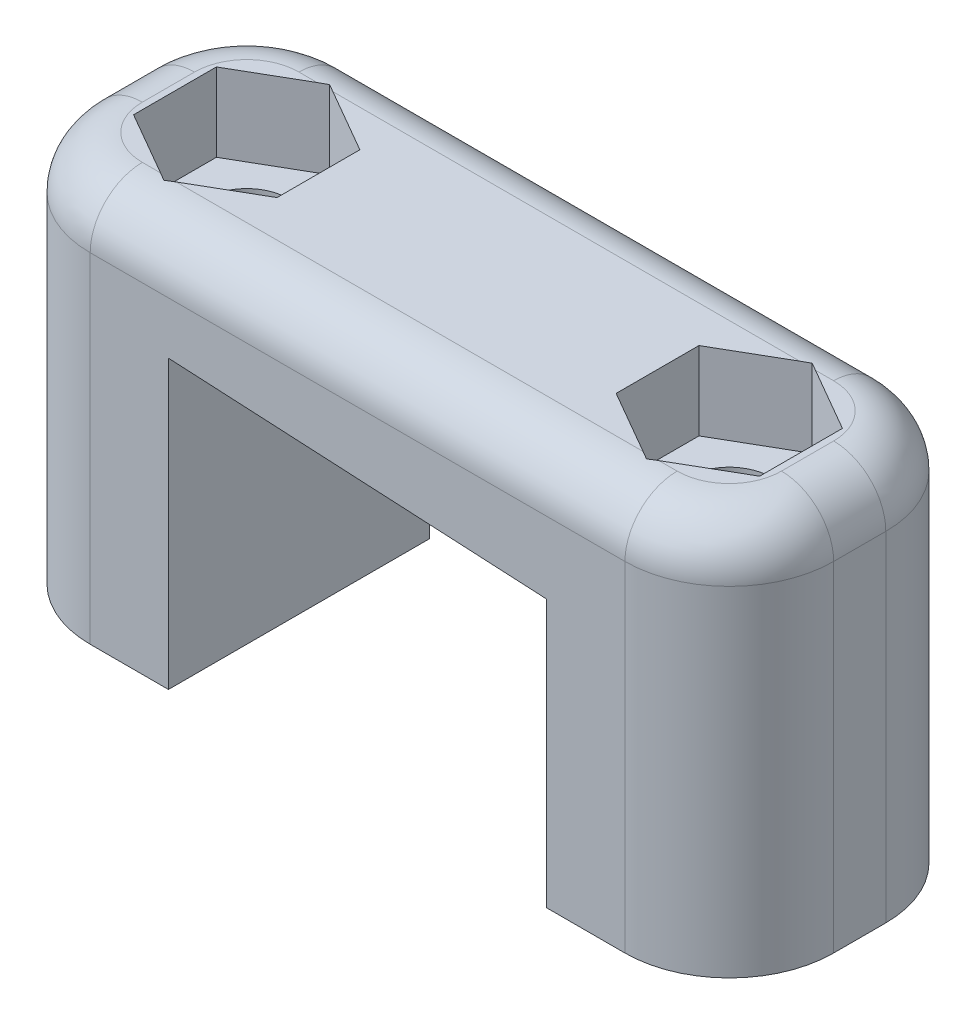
ISO-10303-21;
HEADER;
FILE_DESCRIPTION(('STEP AP214'),'2;1');
FILE_NAME('part.step','',(''),(''),'','','');
FILE_SCHEMA(('AUTOMOTIVE_DESIGN { 1 0 10303 214 1 1 1 1 }'));
ENDSEC;
DATA;
#1=APPLICATION_CONTEXT('core data for automotive mechanical design processes');
#2=APPLICATION_PROTOCOL_DEFINITION('international standard','automotive_design',2000,#1);
#3=PRODUCT_CONTEXT('',#1,'mechanical');
#4=PRODUCT('Part','Part','',(#3));
#5=PRODUCT_RELATED_PRODUCT_CATEGORY('part','',(#4));
#6=PRODUCT_DEFINITION_FORMATION('','',#4);
#7=PRODUCT_DEFINITION_CONTEXT('part definition',#1,'design');
#8=PRODUCT_DEFINITION('design','',#6,#7);
#9=PRODUCT_DEFINITION_SHAPE('','',#8);
#10=(LENGTH_UNIT() NAMED_UNIT(*) SI_UNIT(.MILLI.,.METRE.));
#11=(NAMED_UNIT(*) PLANE_ANGLE_UNIT() SI_UNIT($,.RADIAN.));
#12=(NAMED_UNIT(*) SI_UNIT($,.STERADIAN.) SOLID_ANGLE_UNIT());
#13=UNCERTAINTY_MEASURE_WITH_UNIT(LENGTH_MEASURE(1.E-05),#10,'distance_accuracy_value','');
#14=(GEOMETRIC_REPRESENTATION_CONTEXT(3) GLOBAL_UNCERTAINTY_ASSIGNED_CONTEXT((#13)) GLOBAL_UNIT_ASSIGNED_CONTEXT((#10,
#11,#12)) REPRESENTATION_CONTEXT('',''));
#15=CARTESIAN_POINT('',(0.,0.,0.));
#16=DIRECTION('',(0.,0.,1.));
#17=DIRECTION('',(1.,0.,0.));
#18=AXIS2_PLACEMENT_3D('',#15,#16,#17);
#19=CARTESIAN_POINT('',(28.5,0.,10.));
#20=DIRECTION('',(0.,-1.,0.));
#21=DIRECTION('',(1.,0.,0.));
#22=AXIS2_PLACEMENT_3D('',#19,#20,#21);
#23=PLANE('',#22);
#24=DIRECTION('',(-1.,0.,0.));
#25=VECTOR('',#24,1.);
#26=CARTESIAN_POINT('',(28.5,0.,2.));
#27=LINE('',#26,#25);
#28=CARTESIAN_POINT('',(23.1961524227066,0.,2.));
#29=VERTEX_POINT('',#28);
#30=CARTESIAN_POINT('',(5.30384757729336,0.,2.));
#31=VERTEX_POINT('',#30);
#32=EDGE_CURVE('E268',#29,#31,#27,.T.);
#33=ORIENTED_EDGE('',*,*,#32,.T.);
#34=DIRECTION('',(-0.866025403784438,0.,-0.500000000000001));
#35=VECTOR('',#34,1.);
#36=CARTESIAN_POINT('',(7.74999999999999,0.,3.41228675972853));
#37=LINE('',#36,#35);
#38=CARTESIAN_POINT('',(7.74999999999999,0.,3.41228675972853));
#39=VERTEX_POINT('',#38);
#40=EDGE_CURVE('E248',#39,#31,#37,.T.);
#41=ORIENTED_EDGE('',*,*,#40,.F.);
#42=DIRECTION('',(0.,0.,-1.));
#43=VECTOR('',#42,1.);
#44=CARTESIAN_POINT('',(7.74999999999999,0.,6.58771324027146));
#45=LINE('',#44,#43);
#46=CARTESIAN_POINT('',(7.74999999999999,0.,6.58771324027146));
#47=VERTEX_POINT('',#46);
#48=EDGE_CURVE('E259',#47,#39,#45,.T.);
#49=ORIENTED_EDGE('',*,*,#48,.F.);
#50=DIRECTION('',(0.866025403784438,0.,-0.5));
#51=VECTOR('',#50,1.);
#52=CARTESIAN_POINT('',(5.,0.,8.17542648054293));
#53=LINE('',#52,#51);
#54=CARTESIAN_POINT('',(5.30384757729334,0.,8.));
#55=VERTEX_POINT('',#54);
#56=EDGE_CURVE('E263',#55,#47,#53,.T.);
#57=ORIENTED_EDGE('',*,*,#56,.F.);
#58=DIRECTION('',(-1.,0.,0.));
#59=VECTOR('',#58,1.);
#60=CARTESIAN_POINT('',(28.5,0.,8.));
#61=LINE('',#60,#59);
#62=CARTESIAN_POINT('',(23.1961524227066,0.,8.));
#63=VERTEX_POINT('',#62);
#64=EDGE_CURVE('E397',#55,#63,#61,.F.);
#65=ORIENTED_EDGE('',*,*,#64,.T.);
#66=DIRECTION('',(0.866025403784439,0.,0.5));
#67=VECTOR('',#66,1.);
#68=CARTESIAN_POINT('',(20.75,0.,6.58771324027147));
#69=LINE('',#68,#67);
#70=CARTESIAN_POINT('',(20.75,0.,6.58771324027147));
#71=VERTEX_POINT('',#70);
#72=EDGE_CURVE('E319',#71,#63,#69,.T.);
#73=ORIENTED_EDGE('',*,*,#72,.F.);
#74=DIRECTION('',(0.,0.,1.));
#75=VECTOR('',#74,1.);
#76=CARTESIAN_POINT('',(20.75,0.,3.41228675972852));
#77=LINE('',#76,#75);
#78=CARTESIAN_POINT('',(20.75,0.,3.41228675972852));
#79=VERTEX_POINT('',#78);
#80=EDGE_CURVE('E316',#79,#71,#77,.T.);
#81=ORIENTED_EDGE('',*,*,#80,.F.);
#82=DIRECTION('',(-0.866025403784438,0.,0.5));
#83=VECTOR('',#82,1.);
#84=CARTESIAN_POINT('',(23.5,0.,1.82457351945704));
#85=LINE('',#84,#83);
#86=EDGE_CURVE('E314',#29,#79,#85,.T.);
#87=ORIENTED_EDGE('',*,*,#86,.F.);
#88=EDGE_LOOP('',(#33,#41,#49,#57,#65,#73,#81,#87));
#89=FACE_BOUND('',#88,.T.);
#90=ADVANCED_FACE('F37',(#89),#23,.F.);
#91=CARTESIAN_POINT('',(5.,0.,5.));
#92=DIRECTION('',(0.,-1.,0.));
#93=DIRECTION('',(0.,0.,-1.));
#94=AXIS2_PLACEMENT_3D('',#91,#92,#93);
#95=CYLINDRICAL_SURFACE('',#94,1.6);
#96=CARTESIAN_POINT('',(5.,-15.,5.));
#97=DIRECTION('',(0.,-1.,0.));
#98=DIRECTION('',(0.,0.,-1.));
#99=AXIS2_PLACEMENT_3D('',#96,#97,#98);
#100=CIRCLE('',#99,1.6);
#101=CARTESIAN_POINT('',(5.,-15.,3.4));
#102=VERTEX_POINT('',#101);
#103=EDGE_CURVE('E341',#102,#102,#100,.T.);
#104=ORIENTED_EDGE('',*,*,#103,.T.);
#105=EDGE_LOOP('',(#104));
#106=FACE_BOUND('',#105,.T.);
#107=CARTESIAN_POINT('',(5.,-3.,5.));
#108=DIRECTION('',(0.,1.,0.));
#109=DIRECTION('',(-1.,0.,0.));
#110=AXIS2_PLACEMENT_3D('',#107,#108,#109);
#111=CIRCLE('',#110,1.6);
#112=CARTESIAN_POINT('',(3.4,-3.,5.));
#113=VERTEX_POINT('',#112);
#114=EDGE_CURVE('E269',#113,#113,#111,.F.);
#115=ORIENTED_EDGE('',*,*,#114,.F.);
#116=EDGE_LOOP('',(#115));
#117=FACE_BOUND('',#116,.T.);
#118=ADVANCED_FACE('F603',(#106,#117),#95,.F.);
#119=CARTESIAN_POINT('',(24.5,0.,2.));
#120=VERTEX_POINT('',#119);
#121=CARTESIAN_POINT('',(23.8038475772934,0.,2.));
#122=VERTEX_POINT('',#121);
#123=EDGE_CURVE('E404',#120,#122,#27,.T.);
#124=ORIENTED_EDGE('',*,*,#123,.T.);
#125=DIRECTION('',(-0.866025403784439,0.,-0.5));
#126=VECTOR('',#125,1.);
#127=CARTESIAN_POINT('',(26.25,0.,3.41228675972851));
#128=LINE('',#127,#126);
#129=CARTESIAN_POINT('',(26.25,0.,3.41228675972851));
#130=VERTEX_POINT('',#129);
#131=EDGE_CURVE('E273',#130,#122,#128,.T.);
#132=ORIENTED_EDGE('',*,*,#131,.F.);
#133=DIRECTION('',(0.,0.,-1.));
#134=VECTOR('',#133,1.);
#135=CARTESIAN_POINT('',(26.25,0.,6.58771324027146));
#136=LINE('',#135,#134);
#137=CARTESIAN_POINT('',(26.25,0.,6.58771324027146));
#138=VERTEX_POINT('',#137);
#139=EDGE_CURVE('E298',#138,#130,#136,.T.);
#140=ORIENTED_EDGE('',*,*,#139,.F.);
#141=DIRECTION('',(0.866025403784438,0.,-0.5));
#142=VECTOR('',#141,1.);
#143=CARTESIAN_POINT('',(23.5,0.,8.17542648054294));
#144=LINE('',#143,#142);
#145=CARTESIAN_POINT('',(23.8038475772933,0.,8.));
#146=VERTEX_POINT('',#145);
#147=EDGE_CURVE('E322',#146,#138,#144,.T.);
#148=ORIENTED_EDGE('',*,*,#147,.F.);
#149=CARTESIAN_POINT('',(24.5,0.,8.));
#150=VERTEX_POINT('',#149);
#151=EDGE_CURVE('E392',#146,#150,#61,.F.);
#152=ORIENTED_EDGE('',*,*,#151,.T.);
#153=CARTESIAN_POINT('',(24.5,0.,6.));
#154=DIRECTION('',(0.,-1.,0.));
#155=DIRECTION('',(1.,0.,0.));
#156=AXIS2_PLACEMENT_3D('',#153,#154,#155);
#157=CIRCLE('',#156,2.);
#158=CARTESIAN_POINT('',(26.5,0.,6.));
#159=VERTEX_POINT('',#158);
#160=EDGE_CURVE('E424',#159,#150,#157,.T.);
#161=ORIENTED_EDGE('',*,*,#160,.F.);
#162=DIRECTION('',(0.,0.,-1.));
#163=VECTOR('',#162,1.);
#164=CARTESIAN_POINT('',(26.5,0.,10.));
#165=LINE('',#164,#163);
#166=CARTESIAN_POINT('',(26.5,0.,4.));
#167=VERTEX_POINT('',#166);
#168=EDGE_CURVE('E396',#159,#167,#165,.T.);
#169=ORIENTED_EDGE('',*,*,#168,.T.);
#170=CARTESIAN_POINT('',(24.5,0.,4.));
#171=DIRECTION('',(0.,-1.,0.));
#172=DIRECTION('',(1.,0.,0.));
#173=AXIS2_PLACEMENT_3D('',#170,#171,#172);
#174=CIRCLE('',#173,2.);
#175=EDGE_CURVE('E422',#120,#167,#174,.T.);
#176=ORIENTED_EDGE('',*,*,#175,.F.);
#177=EDGE_LOOP('',(#124,#132,#140,#148,#152,#161,#169,#176));
#178=FACE_BOUND('',#177,.T.);
#179=ADVANCED_FACE('F518',(#178),#23,.F.);
#180=CARTESIAN_POINT('',(23.5,0.,5.));
#181=DIRECTION('',(0.,-1.,0.));
#182=DIRECTION('',(0.,0.,-1.));
#183=AXIS2_PLACEMENT_3D('',#180,#181,#182);
#184=CYLINDRICAL_SURFACE('',#183,1.60000000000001);
#185=CARTESIAN_POINT('',(23.5,-15.,5.));
#186=DIRECTION('',(0.,-1.,0.));
#187=DIRECTION('',(0.,0.,-1.));
#188=AXIS2_PLACEMENT_3D('',#185,#186,#187);
#189=CIRCLE('',#188,1.60000000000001);
#190=CARTESIAN_POINT('',(23.5,-15.,3.4));
#191=VERTEX_POINT('',#190);
#192=EDGE_CURVE('E344',#191,#191,#189,.T.);
#193=ORIENTED_EDGE('',*,*,#192,.T.);
#194=EDGE_LOOP('',(#193));
#195=FACE_BOUND('',#194,.T.);
#196=CARTESIAN_POINT('',(23.5,-3.,5.));
#197=DIRECTION('',(0.,1.,0.));
#198=DIRECTION('',(-1.,0.,0.));
#199=AXIS2_PLACEMENT_3D('',#196,#197,#198);
#200=CIRCLE('',#199,1.60000000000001);
#201=CARTESIAN_POINT('',(21.9,-3.,5.));
#202=VERTEX_POINT('',#201);
#203=EDGE_CURVE('E328',#202,#202,#200,.F.);
#204=ORIENTED_EDGE('',*,*,#203,.F.);
#205=EDGE_LOOP('',(#204));
#206=FACE_BOUND('',#205,.T.);
#207=ADVANCED_FACE('F614',(#195,#206),#184,.F.);
#208=CARTESIAN_POINT('',(4.,0.,8.));
#209=VERTEX_POINT('',#208);
#210=CARTESIAN_POINT('',(4.69615242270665,0.,8.));
#211=VERTEX_POINT('',#210);
#212=EDGE_CURVE('E393',#209,#211,#61,.F.);
#213=ORIENTED_EDGE('',*,*,#212,.T.);
#214=DIRECTION('',(0.866025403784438,0.,0.5));
#215=VECTOR('',#214,1.);
#216=CARTESIAN_POINT('',(2.25000000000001,0.,6.58771324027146));
#217=LINE('',#216,#215);
#218=CARTESIAN_POINT('',(2.25000000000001,0.,6.58771324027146));
#219=VERTEX_POINT('',#218);
#220=EDGE_CURVE('E501',#219,#211,#217,.T.);
#221=ORIENTED_EDGE('',*,*,#220,.F.);
#222=DIRECTION('',(0.,0.,1.));
#223=VECTOR('',#222,1.);
#224=CARTESIAN_POINT('',(2.25000000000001,0.,3.41228675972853));
#225=LINE('',#224,#223);
#226=CARTESIAN_POINT('',(2.25000000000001,0.,3.41228675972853));
#227=VERTEX_POINT('',#226);
#228=EDGE_CURVE('E275',#227,#219,#225,.T.);
#229=ORIENTED_EDGE('',*,*,#228,.F.);
#230=DIRECTION('',(-0.866025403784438,0.,0.500000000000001));
#231=VECTOR('',#230,1.);
#232=CARTESIAN_POINT('',(5.,0.,1.82457351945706));
#233=LINE('',#232,#231);
#234=CARTESIAN_POINT('',(4.69615242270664,0.,2.));
#235=VERTEX_POINT('',#234);
#236=EDGE_CURVE('E270',#235,#227,#233,.T.);
#237=ORIENTED_EDGE('',*,*,#236,.F.);
#238=CARTESIAN_POINT('',(4.,0.,2.));
#239=VERTEX_POINT('',#238);
#240=EDGE_CURVE('E403',#235,#239,#27,.T.);
#241=ORIENTED_EDGE('',*,*,#240,.T.);
#242=CARTESIAN_POINT('',(4.,0.,4.));
#243=DIRECTION('',(0.,-1.,0.));
#244=DIRECTION('',(1.,0.,0.));
#245=AXIS2_PLACEMENT_3D('',#242,#243,#244);
#246=CIRCLE('',#245,2.);
#247=CARTESIAN_POINT('',(2.,0.,4.));
#248=VERTEX_POINT('',#247);
#249=EDGE_CURVE('E416',#248,#239,#246,.T.);
#250=ORIENTED_EDGE('',*,*,#249,.F.);
#251=DIRECTION('',(0.,0.,-1.));
#252=VECTOR('',#251,1.);
#253=CARTESIAN_POINT('',(2.,0.,10.));
#254=LINE('',#253,#252);
#255=CARTESIAN_POINT('',(2.,0.,6.));
#256=VERTEX_POINT('',#255);
#257=EDGE_CURVE('E400',#248,#256,#254,.F.);
#258=ORIENTED_EDGE('',*,*,#257,.T.);
#259=CARTESIAN_POINT('',(4.,0.,6.));
#260=DIRECTION('',(0.,-1.,0.));
#261=DIRECTION('',(1.,0.,0.));
#262=AXIS2_PLACEMENT_3D('',#259,#260,#261);
#263=CIRCLE('',#262,2.);
#264=EDGE_CURVE('E419',#209,#256,#263,.T.);
#265=ORIENTED_EDGE('',*,*,#264,.F.);
#266=EDGE_LOOP('',(#213,#221,#229,#237,#241,#250,#258,#265));
#267=FACE_BOUND('',#266,.T.);
#268=ADVANCED_FACE('F605',(#267),#23,.F.);
#269=CARTESIAN_POINT('',(0.,0.,10.));
#270=DIRECTION('',(1.,0.,0.));
#271=DIRECTION('',(0.,1.,0.));
#272=AXIS2_PLACEMENT_3D('',#269,#270,#271);
#273=PLANE('',#272);
#274=DIRECTION('',(0.,0.,-1.));
#275=VECTOR('',#274,1.);
#276=CARTESIAN_POINT('',(0.,-2.,10.));
#277=LINE('',#276,#275);
#278=CARTESIAN_POINT('',(0.,-2.,6.));
#279=VERTEX_POINT('',#278);
#280=CARTESIAN_POINT('',(0.,-2.,4.));
#281=VERTEX_POINT('',#280);
#282=EDGE_CURVE('E389',#279,#281,#277,.T.);
#283=ORIENTED_EDGE('',*,*,#282,.T.);
#284=DIRECTION('',(0.,-1.,0.));
#285=VECTOR('',#284,1.);
#286=CARTESIAN_POINT('',(0.,0.,4.));
#287=LINE('',#286,#285);
#288=CARTESIAN_POINT('',(0.,-15.,4.));
#289=VERTEX_POINT('',#288);
#290=EDGE_CURVE('E448',#281,#289,#287,.T.);
#291=ORIENTED_EDGE('',*,*,#290,.T.);
#292=DIRECTION('',(0.,0.,-1.));
#293=VECTOR('',#292,1.);
#294=CARTESIAN_POINT('',(0.,-15.,10.));
#295=LINE('',#294,#293);
#296=CARTESIAN_POINT('',(0.,-15.,6.));
#297=VERTEX_POINT('',#296);
#298=EDGE_CURVE('E386',#297,#289,#295,.T.);
#299=ORIENTED_EDGE('',*,*,#298,.F.);
#300=DIRECTION('',(0.,-1.,0.));
#301=VECTOR('',#300,1.);
#302=CARTESIAN_POINT('',(0.,-2.,6.));
#303=LINE('',#302,#301);
#304=EDGE_CURVE('E446',#297,#279,#303,.F.);
#305=ORIENTED_EDGE('',*,*,#304,.T.);
#306=EDGE_LOOP('',(#283,#291,#299,#305));
#307=FACE_BOUND('',#306,.T.);
#308=ADVANCED_FACE('F616',(#307),#273,.F.);
#309=CARTESIAN_POINT('',(0.,-15.,10.));
#310=DIRECTION('',(0.,1.,0.));
#311=DIRECTION('',(-1.,0.,0.));
#312=AXIS2_PLACEMENT_3D('',#309,#310,#311);
#313=PLANE('',#312);
#314=ORIENTED_EDGE('',*,*,#103,.F.);
#315=EDGE_LOOP('',(#314));
#316=FACE_BOUND('',#315,.T.);
#317=ORIENTED_EDGE('',*,*,#298,.T.);
#318=CARTESIAN_POINT('',(4.00000000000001,-15.,4.));
#319=DIRECTION('',(0.,1.,0.));
#320=DIRECTION('',(-1.,0.,0.));
#321=AXIS2_PLACEMENT_3D('',#318,#319,#320);
#322=CIRCLE('',#321,4.);
#323=CARTESIAN_POINT('',(4.00000000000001,-15.,0.));
#324=VERTEX_POINT('',#323);
#325=EDGE_CURVE('E452',#289,#324,#322,.F.);
#326=ORIENTED_EDGE('',*,*,#325,.T.);
#327=DIRECTION('',(1.,0.,0.));
#328=VECTOR('',#327,1.);
#329=CARTESIAN_POINT('',(0.,-15.,0.));
#330=LINE('',#329,#328);
#331=CARTESIAN_POINT('',(7.,-15.,0.));
#332=VERTEX_POINT('',#331);
#333=EDGE_CURVE('E361',#324,#332,#330,.T.);
#334=ORIENTED_EDGE('',*,*,#333,.T.);
#335=DIRECTION('',(0.,0.,-1.));
#336=VECTOR('',#335,1.);
#337=CARTESIAN_POINT('',(7.,-15.,10.));
#338=LINE('',#337,#336);
#339=CARTESIAN_POINT('',(7.,-15.,10.));
#340=VERTEX_POINT('',#339);
#341=EDGE_CURVE('E383',#340,#332,#338,.T.);
#342=ORIENTED_EDGE('',*,*,#341,.F.);
#343=DIRECTION('',(1.,0.,0.));
#344=VECTOR('',#343,1.);
#345=CARTESIAN_POINT('',(0.,-15.,10.));
#346=LINE('',#345,#344);
#347=CARTESIAN_POINT('',(4.00000000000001,-15.,10.));
#348=VERTEX_POINT('',#347);
#349=EDGE_CURVE('E348',#348,#340,#346,.T.);
#350=ORIENTED_EDGE('',*,*,#349,.F.);
#351=CARTESIAN_POINT('',(4.00000000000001,-15.,6.));
#352=DIRECTION('',(0.,1.,0.));
#353=DIRECTION('',(-1.,0.,0.));
#354=AXIS2_PLACEMENT_3D('',#351,#352,#353);
#355=CIRCLE('',#354,4.);
#356=EDGE_CURVE('E450',#348,#297,#355,.F.);
#357=ORIENTED_EDGE('',*,*,#356,.T.);
#358=EDGE_LOOP('',(#317,#326,#334,#342,#350,#357));
#359=FACE_BOUND('',#358,.T.);
#360=ADVANCED_FACE('F622',(#316,#359),#313,.F.);
#361=CARTESIAN_POINT('',(7.,-15.,10.));
#362=DIRECTION('',(-1.,0.,0.));
#363=DIRECTION('',(0.,-1.,0.));
#364=AXIS2_PLACEMENT_3D('',#361,#362,#363);
#365=PLANE('',#364);
#366=DIRECTION('',(0.,1.,0.));
#367=VECTOR('',#366,1.);
#368=CARTESIAN_POINT('',(7.,-15.,0.));
#369=LINE('',#368,#367);
#370=CARTESIAN_POINT('',(7.,-3.99999999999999,0.));
#371=VERTEX_POINT('',#370);
#372=EDGE_CURVE('E363',#332,#371,#369,.T.);
#373=ORIENTED_EDGE('',*,*,#372,.T.);
#374=DIRECTION('',(0.,0.,-1.));
#375=VECTOR('',#374,1.);
#376=CARTESIAN_POINT('',(7.,-3.99999999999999,10.));
#377=LINE('',#376,#375);
#378=CARTESIAN_POINT('',(7.,-3.99999999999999,10.));
#379=VERTEX_POINT('',#378);
#380=EDGE_CURVE('E380',#379,#371,#377,.T.);
#381=ORIENTED_EDGE('',*,*,#380,.F.);
#382=DIRECTION('',(0.,1.,0.));
#383=VECTOR('',#382,1.);
#384=CARTESIAN_POINT('',(7.,-15.,10.));
#385=LINE('',#384,#383);
#386=EDGE_CURVE('E350',#340,#379,#385,.T.);
#387=ORIENTED_EDGE('',*,*,#386,.F.);
#388=ORIENTED_EDGE('',*,*,#341,.T.);
#389=EDGE_LOOP('',(#373,#381,#387,#388));
#390=FACE_BOUND('',#389,.T.);
#391=ADVANCED_FACE('F661',(#390),#365,.F.);
#392=CARTESIAN_POINT('',(7.,-3.99999999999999,10.));
#393=DIRECTION('',(0.0516550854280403,0.998664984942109,0.));
#394=DIRECTION('',(-0.998664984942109,0.0516550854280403,0.));
#395=AXIS2_PLACEMENT_3D('',#392,#393,#394);
#396=PLANE('',#395);
#397=DIRECTION('',(0.998664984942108,-0.0516550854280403,0.));
#398=VECTOR('',#397,1.);
#399=CARTESIAN_POINT('',(7.,-3.99999999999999,0.));
#400=LINE('',#399,#398);
#401=CARTESIAN_POINT('',(21.5,-4.74999999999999,0.));
#402=VERTEX_POINT('',#401);
#403=EDGE_CURVE('E366',#371,#402,#400,.T.);
#404=ORIENTED_EDGE('',*,*,#403,.T.);
#405=DIRECTION('',(0.,0.,-1.));
#406=VECTOR('',#405,1.);
#407=CARTESIAN_POINT('',(21.5,-4.74999999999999,10.));
#408=LINE('',#407,#406);
#409=CARTESIAN_POINT('',(21.5,-4.74999999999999,10.));
#410=VERTEX_POINT('',#409);
#411=EDGE_CURVE('E377',#410,#402,#408,.T.);
#412=ORIENTED_EDGE('',*,*,#411,.F.);
#413=DIRECTION('',(0.998664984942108,-0.0516550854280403,0.));
#414=VECTOR('',#413,1.);
#415=CARTESIAN_POINT('',(7.,-3.99999999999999,10.));
#416=LINE('',#415,#414);
#417=EDGE_CURVE('E353',#379,#410,#416,.T.);
#418=ORIENTED_EDGE('',*,*,#417,.F.);
#419=ORIENTED_EDGE('',*,*,#380,.T.);
#420=EDGE_LOOP('',(#404,#412,#418,#419));
#421=FACE_BOUND('',#420,.T.);
#422=ADVANCED_FACE('F664',(#421),#396,.F.);
#423=CARTESIAN_POINT('',(21.5,-4.74999999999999,10.));
#424=DIRECTION('',(1.,0.,0.));
#425=DIRECTION('',(0.,1.,0.));
#426=AXIS2_PLACEMENT_3D('',#423,#424,#425);
#427=PLANE('',#426);
#428=DIRECTION('',(0.,-1.,0.));
#429=VECTOR('',#428,1.);
#430=CARTESIAN_POINT('',(21.5,-4.74999999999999,0.));
#431=LINE('',#430,#429);
#432=CARTESIAN_POINT('',(21.5,-15.,0.));
#433=VERTEX_POINT('',#432);
#434=EDGE_CURVE('E368',#402,#433,#431,.T.);
#435=ORIENTED_EDGE('',*,*,#434,.T.);
#436=DIRECTION('',(0.,0.,-1.));
#437=VECTOR('',#436,1.);
#438=CARTESIAN_POINT('',(21.5,-15.,10.));
#439=LINE('',#438,#437);
#440=CARTESIAN_POINT('',(21.5,-15.,10.));
#441=VERTEX_POINT('',#440);
#442=EDGE_CURVE('E374',#441,#433,#439,.T.);
#443=ORIENTED_EDGE('',*,*,#442,.F.);
#444=DIRECTION('',(0.,-1.,0.));
#445=VECTOR('',#444,1.);
#446=CARTESIAN_POINT('',(21.5,-4.74999999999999,10.));
#447=LINE('',#446,#445);
#448=EDGE_CURVE('E355',#410,#441,#447,.T.);
#449=ORIENTED_EDGE('',*,*,#448,.F.);
#450=ORIENTED_EDGE('',*,*,#411,.T.);
#451=EDGE_LOOP('',(#435,#443,#449,#450));
#452=FACE_BOUND('',#451,.T.);
#453=ADVANCED_FACE('F549',(#452),#427,.F.);
#454=CARTESIAN_POINT('',(21.5,-15.,10.));
#455=DIRECTION('',(0.,1.,0.));
#456=DIRECTION('',(-1.,0.,0.));
#457=AXIS2_PLACEMENT_3D('',#454,#455,#456);
#458=PLANE('',#457);
#459=ORIENTED_EDGE('',*,*,#192,.F.);
#460=EDGE_LOOP('',(#459));
#461=FACE_BOUND('',#460,.T.);
#462=DIRECTION('',(1.,0.,0.));
#463=VECTOR('',#462,1.);
#464=CARTESIAN_POINT('',(21.5,-15.,0.));
#465=LINE('',#464,#463);
#466=CARTESIAN_POINT('',(24.5,-15.,0.));
#467=VERTEX_POINT('',#466);
#468=EDGE_CURVE('E351',#433,#467,#465,.T.);
#469=ORIENTED_EDGE('',*,*,#468,.T.);
#470=CARTESIAN_POINT('',(24.5,-15.,4.));
#471=DIRECTION('',(0.,1.,0.));
#472=DIRECTION('',(-1.,0.,0.));
#473=AXIS2_PLACEMENT_3D('',#470,#471,#472);
#474=CIRCLE('',#473,4.);
#475=CARTESIAN_POINT('',(28.5,-15.,4.));
#476=VERTEX_POINT('',#475);
#477=EDGE_CURVE('E468',#467,#476,#474,.F.);
#478=ORIENTED_EDGE('',*,*,#477,.T.);
#479=DIRECTION('',(0.,0.,-1.));
#480=VECTOR('',#479,1.);
#481=CARTESIAN_POINT('',(28.5,-15.,10.));
#482=LINE('',#481,#480);
#483=CARTESIAN_POINT('',(28.5,-15.,6.));
#484=VERTEX_POINT('',#483);
#485=EDGE_CURVE('E360',#484,#476,#482,.T.);
#486=ORIENTED_EDGE('',*,*,#485,.F.);
#487=CARTESIAN_POINT('',(24.5,-15.,6.));
#488=DIRECTION('',(0.,1.,0.));
#489=DIRECTION('',(-1.,0.,0.));
#490=AXIS2_PLACEMENT_3D('',#487,#488,#489);
#491=CIRCLE('',#490,4.);
#492=CARTESIAN_POINT('',(24.5,-15.,10.));
#493=VERTEX_POINT('',#492);
#494=EDGE_CURVE('E466',#484,#493,#491,.F.);
#495=ORIENTED_EDGE('',*,*,#494,.T.);
#496=DIRECTION('',(1.,0.,0.));
#497=VECTOR('',#496,1.);
#498=CARTESIAN_POINT('',(21.5,-15.,10.));
#499=LINE('',#498,#497);
#500=EDGE_CURVE('E357',#441,#493,#499,.T.);
#501=ORIENTED_EDGE('',*,*,#500,.F.);
#502=ORIENTED_EDGE('',*,*,#442,.T.);
#503=EDGE_LOOP('',(#469,#478,#486,#495,#501,#502));
#504=FACE_BOUND('',#503,.T.);
#505=ADVANCED_FACE('F541',(#461,#504),#458,.F.);
#506=CARTESIAN_POINT('',(28.5,-15.,10.));
#507=DIRECTION('',(-1.,0.,0.));
#508=DIRECTION('',(0.,-1.,0.));
#509=AXIS2_PLACEMENT_3D('',#506,#507,#508);
#510=PLANE('',#509);
#511=ORIENTED_EDGE('',*,*,#485,.T.);
#512=DIRECTION('',(0.,1.,0.));
#513=VECTOR('',#512,1.);
#514=CARTESIAN_POINT('',(28.5,-15.,4.));
#515=LINE('',#514,#513);
#516=CARTESIAN_POINT('',(28.5,-1.99999999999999,4.));
#517=VERTEX_POINT('',#516);
#518=EDGE_CURVE('E464',#476,#517,#515,.T.);
#519=ORIENTED_EDGE('',*,*,#518,.T.);
#520=DIRECTION('',(0.,0.,-1.));
#521=VECTOR('',#520,1.);
#522=CARTESIAN_POINT('',(28.5,-1.99999999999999,10.));
#523=LINE('',#522,#521);
#524=CARTESIAN_POINT('',(28.5,-1.99999999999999,6.));
#525=VERTEX_POINT('',#524);
#526=EDGE_CURVE('E407',#517,#525,#523,.F.);
#527=ORIENTED_EDGE('',*,*,#526,.T.);
#528=DIRECTION('',(0.,1.,0.));
#529=VECTOR('',#528,1.);
#530=CARTESIAN_POINT('',(28.5,-15.,6.));
#531=LINE('',#530,#529);
#532=EDGE_CURVE('E462',#525,#484,#531,.F.);
#533=ORIENTED_EDGE('',*,*,#532,.T.);
#534=EDGE_LOOP('',(#511,#519,#527,#533));
#535=FACE_BOUND('',#534,.T.);
#536=ADVANCED_FACE('F532',(#535),#510,.F.);
#537=CARTESIAN_POINT('',(0.,0.,10.));
#538=DIRECTION('',(0.,0.,1.));
#539=DIRECTION('',(1.,0.,0.));
#540=AXIS2_PLACEMENT_3D('',#537,#538,#539);
#541=PLANE('',#540);
#542=DIRECTION('',(-1.,0.,0.));
#543=VECTOR('',#542,1.);
#544=CARTESIAN_POINT('',(0.,-2.,10.));
#545=LINE('',#544,#543);
#546=CARTESIAN_POINT('',(24.5,-2.,10.));
#547=VERTEX_POINT('',#546);
#548=CARTESIAN_POINT('',(4.,-2.,10.));
#549=VERTEX_POINT('',#548);
#550=EDGE_CURVE('E413',#547,#549,#545,.T.);
#551=ORIENTED_EDGE('',*,*,#550,.T.);
#552=DIRECTION('',(0.,-1.,0.));
#553=VECTOR('',#552,1.);
#554=CARTESIAN_POINT('',(4.00000000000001,-15.,10.));
#555=LINE('',#554,#553);
#556=EDGE_CURVE('E460',#549,#348,#555,.T.);
#557=ORIENTED_EDGE('',*,*,#556,.T.);
#558=ORIENTED_EDGE('',*,*,#349,.T.);
#559=ORIENTED_EDGE('',*,*,#386,.T.);
#560=ORIENTED_EDGE('',*,*,#417,.T.);
#561=ORIENTED_EDGE('',*,*,#448,.T.);
#562=ORIENTED_EDGE('',*,*,#500,.T.);
#563=DIRECTION('',(0.,1.,0.));
#564=VECTOR('',#563,1.);
#565=CARTESIAN_POINT('',(24.5,-2.,10.));
#566=LINE('',#565,#564);
#567=EDGE_CURVE('E458',#493,#547,#566,.T.);
#568=ORIENTED_EDGE('',*,*,#567,.T.);
#569=EDGE_LOOP('',(#551,#557,#558,#559,#560,#561,#562,#568));
#570=FACE_BOUND('',#569,.T.);
#571=ADVANCED_FACE('F543',(#570),#541,.T.);
#572=CARTESIAN_POINT('',(0.,0.,0.));
#573=DIRECTION('',(0.,0.,1.));
#574=DIRECTION('',(1.,0.,0.));
#575=AXIS2_PLACEMENT_3D('',#572,#573,#574);
#576=PLANE('',#575);
#577=ORIENTED_EDGE('',*,*,#333,.F.);
#578=DIRECTION('',(0.,-1.,0.));
#579=VECTOR('',#578,1.);
#580=CARTESIAN_POINT('',(4.,0.,0.));
#581=LINE('',#580,#579);
#582=CARTESIAN_POINT('',(4.,-2.,0.));
#583=VERTEX_POINT('',#582);
#584=EDGE_CURVE('E456',#324,#583,#581,.F.);
#585=ORIENTED_EDGE('',*,*,#584,.T.);
#586=DIRECTION('',(-1.,0.,0.));
#587=VECTOR('',#586,1.);
#588=CARTESIAN_POINT('',(0.,-2.,0.));
#589=LINE('',#588,#587);
#590=CARTESIAN_POINT('',(24.5,-2.,0.));
#591=VERTEX_POINT('',#590);
#592=EDGE_CURVE('E410',#583,#591,#589,.F.);
#593=ORIENTED_EDGE('',*,*,#592,.T.);
#594=DIRECTION('',(0.,1.,0.));
#595=VECTOR('',#594,1.);
#596=CARTESIAN_POINT('',(24.5,0.,0.));
#597=LINE('',#596,#595);
#598=EDGE_CURVE('E454',#591,#467,#597,.F.);
#599=ORIENTED_EDGE('',*,*,#598,.T.);
#600=ORIENTED_EDGE('',*,*,#468,.F.);
#601=ORIENTED_EDGE('',*,*,#434,.F.);
#602=ORIENTED_EDGE('',*,*,#403,.F.);
#603=ORIENTED_EDGE('',*,*,#372,.F.);
#604=EDGE_LOOP('',(#577,#585,#593,#599,#600,#601,#602,#603));
#605=FACE_BOUND('',#604,.T.);
#606=ADVANCED_FACE('F555',(#605),#576,.F.);
#607=CARTESIAN_POINT('',(26.5,-2.,10.));
#608=DIRECTION('',(0.,0.,-1.));
#609=DIRECTION('',(-1.,0.,0.));
#610=AXIS2_PLACEMENT_3D('',#607,#608,#609);
#611=CYLINDRICAL_SURFACE('',#610,2.);
#612=ORIENTED_EDGE('',*,*,#526,.F.);
#613=CARTESIAN_POINT('',(26.5,-2.,4.));
#614=DIRECTION('',(0.,0.,1.));
#615=DIRECTION('',(1.,0.,0.));
#616=AXIS2_PLACEMENT_3D('',#613,#614,#615);
#617=CIRCLE('',#616,2.);
#618=EDGE_CURVE('E434',#517,#167,#617,.T.);
#619=ORIENTED_EDGE('',*,*,#618,.T.);
#620=ORIENTED_EDGE('',*,*,#168,.F.);
#621=CARTESIAN_POINT('',(26.5,-2.,6.));
#622=DIRECTION('',(0.,0.,-1.));
#623=DIRECTION('',(-1.,0.,0.));
#624=AXIS2_PLACEMENT_3D('',#621,#622,#623);
#625=CIRCLE('',#624,2.);
#626=EDGE_CURVE('E432',#159,#525,#625,.T.);
#627=ORIENTED_EDGE('',*,*,#626,.T.);
#628=EDGE_LOOP('',(#612,#619,#620,#627));
#629=FACE_BOUND('',#628,.T.);
#630=ADVANCED_FACE('F528',(#629),#611,.T.);
#631=CARTESIAN_POINT('',(0.,-2.,8.));
#632=DIRECTION('',(1.,0.,0.));
#633=DIRECTION('',(0.,1.,0.));
#634=AXIS2_PLACEMENT_3D('',#631,#632,#633);
#635=CYLINDRICAL_SURFACE('',#634,2.);
#636=CARTESIAN_POINT('',(5.30384757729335,-2.,8.));
#637=DIRECTION('',(0.5,0.,0.866025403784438));
#638=DIRECTION('',(0.866025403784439,0.,-0.5));
#639=AXIS2_PLACEMENT_3D('',#636,#637,#638);
#640=ELLIPSE('',#639,4.,2.);
#641=CARTESIAN_POINT('',(5.,-0.0077084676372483,8.17542648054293));
#642=VERTEX_POINT('',#641);
#643=EDGE_CURVE('E11',#642,#55,#640,.F.);
#644=ORIENTED_EDGE('',*,*,#643,.F.);
#645=CARTESIAN_POINT('',(4.69615242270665,-2.,8.));
#646=DIRECTION('',(-0.5,0.,0.866025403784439));
#647=DIRECTION('',(0.866025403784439,0.,0.5));
#648=AXIS2_PLACEMENT_3D('',#645,#646,#647);
#649=ELLIPSE('',#648,4.,2.);
#650=EDGE_CURVE('E45',#211,#642,#649,.F.);
#651=ORIENTED_EDGE('',*,*,#650,.F.);
#652=ORIENTED_EDGE('',*,*,#212,.F.);
#653=CARTESIAN_POINT('',(4.,-2.,8.));
#654=DIRECTION('',(1.,0.,0.));
#655=DIRECTION('',(0.,0.,-1.));
#656=AXIS2_PLACEMENT_3D('',#653,#654,#655);
#657=CIRCLE('',#656,2.);
#658=EDGE_CURVE('E427',#209,#549,#657,.T.);
#659=ORIENTED_EDGE('',*,*,#658,.T.);
#660=ORIENTED_EDGE('',*,*,#550,.F.);
#661=CARTESIAN_POINT('',(24.5,-2.,8.));
#662=DIRECTION('',(-1.,0.,0.));
#663=DIRECTION('',(0.,0.,1.));
#664=AXIS2_PLACEMENT_3D('',#661,#662,#663);
#665=CIRCLE('',#664,2.);
#666=EDGE_CURVE('E429',#547,#150,#665,.T.);
#667=ORIENTED_EDGE('',*,*,#666,.T.);
#668=ORIENTED_EDGE('',*,*,#151,.F.);
#669=CARTESIAN_POINT('',(23.8038475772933,-2.,8.));
#670=DIRECTION('',(0.5,0.,0.866025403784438));
#671=DIRECTION('',(0.866025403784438,0.,-0.5));
#672=AXIS2_PLACEMENT_3D('',#669,#670,#671);
#673=ELLIPSE('',#672,4.,2.);
#674=CARTESIAN_POINT('',(23.5,-0.00770846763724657,8.17542648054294));
#675=VERTEX_POINT('',#674);
#676=EDGE_CURVE('E488',#675,#146,#673,.F.);
#677=ORIENTED_EDGE('',*,*,#676,.F.);
#678=CARTESIAN_POINT('',(23.1961524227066,-2.,8.));
#679=DIRECTION('',(-0.5,0.,0.866025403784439));
#680=DIRECTION('',(0.866025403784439,0.,0.5));
#681=AXIS2_PLACEMENT_3D('',#678,#679,#680);
#682=ELLIPSE('',#681,4.,2.);
#683=EDGE_CURVE('E486',#63,#675,#682,.F.);
#684=ORIENTED_EDGE('',*,*,#683,.F.);
#685=ORIENTED_EDGE('',*,*,#64,.F.);
#686=EDGE_LOOP('',(#644,#651,#652,#659,#660,#667,#668,#677,#684,#685));
#687=FACE_BOUND('',#686,.T.);
#688=ADVANCED_FACE('F510',(#687),#635,.T.);
#689=CARTESIAN_POINT('',(28.5,-2.,2.));
#690=DIRECTION('',(-1.,0.,0.));
#691=DIRECTION('',(0.,-1.,0.));
#692=AXIS2_PLACEMENT_3D('',#689,#690,#691);
#693=CYLINDRICAL_SURFACE('',#692,2.);
#694=CARTESIAN_POINT('',(5.30384757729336,-2.,2.));
#695=DIRECTION('',(0.500000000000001,0.,-0.866025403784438));
#696=DIRECTION('',(-0.866025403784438,0.,-0.500000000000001));
#697=AXIS2_PLACEMENT_3D('',#694,#695,#696);
#698=ELLIPSE('',#697,3.99999999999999,2.);
#699=CARTESIAN_POINT('',(5.,-0.00770846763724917,1.82457351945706));
#700=VERTEX_POINT('',#699);
#701=EDGE_CURVE('E492',#31,#700,#698,.F.);
#702=ORIENTED_EDGE('',*,*,#701,.F.);
#703=ORIENTED_EDGE('',*,*,#32,.F.);
#704=CARTESIAN_POINT('',(23.1961524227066,-2.,2.));
#705=DIRECTION('',(-0.5,0.,-0.866025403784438));
#706=DIRECTION('',(-0.866025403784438,0.,0.5));
#707=AXIS2_PLACEMENT_3D('',#704,#705,#706);
#708=ELLIPSE('',#707,4.,2.);
#709=CARTESIAN_POINT('',(23.5,-0.00770846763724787,1.82457351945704));
#710=VERTEX_POINT('',#709);
#711=EDGE_CURVE('E470',#710,#29,#708,.F.);
#712=ORIENTED_EDGE('',*,*,#711,.F.);
#713=CARTESIAN_POINT('',(23.8038475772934,-2.,2.));
#714=DIRECTION('',(0.5,0.,-0.866025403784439));
#715=DIRECTION('',(-0.866025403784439,0.,-0.5));
#716=AXIS2_PLACEMENT_3D('',#713,#714,#715);
#717=ELLIPSE('',#716,4.,2.);
#718=EDGE_CURVE('E484',#122,#710,#717,.F.);
#719=ORIENTED_EDGE('',*,*,#718,.F.);
#720=ORIENTED_EDGE('',*,*,#123,.F.);
#721=CARTESIAN_POINT('',(24.5,-2.,2.));
#722=DIRECTION('',(-1.,0.,0.));
#723=DIRECTION('',(0.,0.,1.));
#724=AXIS2_PLACEMENT_3D('',#721,#722,#723);
#725=CIRCLE('',#724,2.);
#726=EDGE_CURVE('E441',#120,#591,#725,.T.);
#727=ORIENTED_EDGE('',*,*,#726,.T.);
#728=ORIENTED_EDGE('',*,*,#592,.F.);
#729=CARTESIAN_POINT('',(4.,-2.,2.));
#730=DIRECTION('',(1.,0.,0.));
#731=DIRECTION('',(0.,0.,-1.));
#732=AXIS2_PLACEMENT_3D('',#729,#730,#731);
#733=CIRCLE('',#732,2.);
#734=EDGE_CURVE('E443',#583,#239,#733,.T.);
#735=ORIENTED_EDGE('',*,*,#734,.T.);
#736=ORIENTED_EDGE('',*,*,#240,.F.);
#737=CARTESIAN_POINT('',(4.69615242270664,-2.,2.));
#738=DIRECTION('',(-0.500000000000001,0.,-0.866025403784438));
#739=DIRECTION('',(-0.866025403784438,0.,0.500000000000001));
#740=AXIS2_PLACEMENT_3D('',#737,#738,#739);
#741=ELLIPSE('',#740,3.99999999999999,2.);
#742=EDGE_CURVE('E489',#700,#235,#741,.F.);
#743=ORIENTED_EDGE('',*,*,#742,.F.);
#744=EDGE_LOOP('',(#702,#703,#712,#719,#720,#727,#728,#735,#736,#743));
#745=FACE_BOUND('',#744,.T.);
#746=ADVANCED_FACE('F569',(#745),#693,.T.);
#747=CARTESIAN_POINT('',(2.,-2.,10.));
#748=DIRECTION('',(0.,0.,-1.));
#749=DIRECTION('',(-1.,0.,0.));
#750=AXIS2_PLACEMENT_3D('',#747,#748,#749);
#751=CYLINDRICAL_SURFACE('',#750,2.);
#752=ORIENTED_EDGE('',*,*,#282,.F.);
#753=CARTESIAN_POINT('',(2.,-2.,6.));
#754=DIRECTION('',(0.,0.,-1.));
#755=DIRECTION('',(-1.,0.,0.));
#756=AXIS2_PLACEMENT_3D('',#753,#754,#755);
#757=CIRCLE('',#756,2.);
#758=EDGE_CURVE('E439',#279,#256,#757,.T.);
#759=ORIENTED_EDGE('',*,*,#758,.T.);
#760=ORIENTED_EDGE('',*,*,#257,.F.);
#761=CARTESIAN_POINT('',(2.,-2.,4.));
#762=DIRECTION('',(0.,0.,1.));
#763=DIRECTION('',(1.,0.,0.));
#764=AXIS2_PLACEMENT_3D('',#761,#762,#763);
#765=CIRCLE('',#764,2.);
#766=EDGE_CURVE('E437',#248,#281,#765,.T.);
#767=ORIENTED_EDGE('',*,*,#766,.T.);
#768=EDGE_LOOP('',(#752,#759,#760,#767));
#769=FACE_BOUND('',#768,.T.);
#770=ADVANCED_FACE('F642',(#769),#751,.T.);
#771=CARTESIAN_POINT('',(24.5,0.,6.));
#772=DIRECTION('',(0.,-1.,0.));
#773=DIRECTION('',(1.,0.,0.));
#774=AXIS2_PLACEMENT_3D('',#771,#772,#773);
#775=CYLINDRICAL_SURFACE('',#774,4.);
#776=ORIENTED_EDGE('',*,*,#494,.F.);
#777=ORIENTED_EDGE('',*,*,#532,.F.);
#778=CARTESIAN_POINT('',(24.5,-2.,6.));
#779=DIRECTION('',(0.,-1.,0.));
#780=DIRECTION('',(1.,0.,0.));
#781=AXIS2_PLACEMENT_3D('',#778,#779,#780);
#782=CIRCLE('',#781,4.);
#783=EDGE_CURVE('E364',#547,#525,#782,.F.);
#784=ORIENTED_EDGE('',*,*,#783,.F.);
#785=ORIENTED_EDGE('',*,*,#567,.F.);
#786=EDGE_LOOP('',(#776,#777,#784,#785));
#787=FACE_BOUND('',#786,.T.);
#788=ADVANCED_FACE('F537',(#787),#775,.T.);
#789=CARTESIAN_POINT('',(24.5,-2.,6.));
#790=DIRECTION('',(0.,-1.,0.));
#791=DIRECTION('',(1.,0.,0.));
#792=AXIS2_PLACEMENT_3D('',#789,#790,#791);
#793=DEGENERATE_TOROIDAL_SURFACE('',#792,2.,2.,.T.);
#794=ORIENTED_EDGE('',*,*,#626,.F.);
#795=ORIENTED_EDGE('',*,*,#160,.T.);
#796=ORIENTED_EDGE('',*,*,#666,.F.);
#797=ORIENTED_EDGE('',*,*,#783,.T.);
#798=EDGE_LOOP('',(#794,#795,#796,#797));
#799=FACE_BOUND('',#798,.T.);
#800=ADVANCED_FACE('F525',(#799),#793,.T.);
#801=CARTESIAN_POINT('',(24.5,-15.,4.));
#802=DIRECTION('',(0.,1.,0.));
#803=DIRECTION('',(-1.,0.,0.));
#804=AXIS2_PLACEMENT_3D('',#801,#802,#803);
#805=CYLINDRICAL_SURFACE('',#804,4.);
#806=ORIENTED_EDGE('',*,*,#477,.F.);
#807=ORIENTED_EDGE('',*,*,#598,.F.);
#808=CARTESIAN_POINT('',(24.5,-1.99999999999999,4.));
#809=DIRECTION('',(0.,-1.,0.));
#810=DIRECTION('',(1.,0.,0.));
#811=AXIS2_PLACEMENT_3D('',#808,#809,#810);
#812=CIRCLE('',#811,4.);
#813=EDGE_CURVE('E473',#517,#591,#812,.F.);
#814=ORIENTED_EDGE('',*,*,#813,.F.);
#815=ORIENTED_EDGE('',*,*,#518,.F.);
#816=EDGE_LOOP('',(#806,#807,#814,#815));
#817=FACE_BOUND('',#816,.T.);
#818=ADVANCED_FACE('F560',(#817),#805,.T.);
#819=CARTESIAN_POINT('',(24.5,-2.,4.));
#820=DIRECTION('',(0.,-1.,0.));
#821=DIRECTION('',(1.,0.,0.));
#822=AXIS2_PLACEMENT_3D('',#819,#820,#821);
#823=DEGENERATE_TOROIDAL_SURFACE('',#822,2.,2.,.T.);
#824=ORIENTED_EDGE('',*,*,#618,.F.);
#825=ORIENTED_EDGE('',*,*,#813,.T.);
#826=ORIENTED_EDGE('',*,*,#726,.F.);
#827=ORIENTED_EDGE('',*,*,#175,.T.);
#828=EDGE_LOOP('',(#824,#825,#826,#827));
#829=FACE_BOUND('',#828,.T.);
#830=ADVANCED_FACE('F564',(#829),#823,.T.);
#831=CARTESIAN_POINT('',(4.,0.,6.));
#832=DIRECTION('',(0.,1.,0.));
#833=DIRECTION('',(-1.,0.,0.));
#834=AXIS2_PLACEMENT_3D('',#831,#832,#833);
#835=CYLINDRICAL_SURFACE('',#834,4.);
#836=ORIENTED_EDGE('',*,*,#356,.F.);
#837=ORIENTED_EDGE('',*,*,#556,.F.);
#838=CARTESIAN_POINT('',(4.,-2.,6.));
#839=DIRECTION('',(0.,-1.,0.));
#840=DIRECTION('',(1.,0.,0.));
#841=AXIS2_PLACEMENT_3D('',#838,#839,#840);
#842=CIRCLE('',#841,4.);
#843=EDGE_CURVE('E476',#279,#549,#842,.F.);
#844=ORIENTED_EDGE('',*,*,#843,.F.);
#845=ORIENTED_EDGE('',*,*,#304,.F.);
#846=EDGE_LOOP('',(#836,#837,#844,#845));
#847=FACE_BOUND('',#846,.T.);
#848=ADVANCED_FACE('F635',(#847),#835,.T.);
#849=CARTESIAN_POINT('',(4.,-2.,6.));
#850=DIRECTION('',(0.,-1.,0.));
#851=DIRECTION('',(1.,0.,0.));
#852=AXIS2_PLACEMENT_3D('',#849,#850,#851);
#853=DEGENERATE_TOROIDAL_SURFACE('',#852,2.,2.,.T.);
#854=ORIENTED_EDGE('',*,*,#658,.F.);
#855=ORIENTED_EDGE('',*,*,#264,.T.);
#856=ORIENTED_EDGE('',*,*,#758,.F.);
#857=ORIENTED_EDGE('',*,*,#843,.T.);
#858=EDGE_LOOP('',(#854,#855,#856,#857));
#859=FACE_BOUND('',#858,.T.);
#860=ADVANCED_FACE('F638',(#859),#853,.T.);
#861=CARTESIAN_POINT('',(4.,0.,4.));
#862=DIRECTION('',(0.,-1.,0.));
#863=DIRECTION('',(1.,0.,0.));
#864=AXIS2_PLACEMENT_3D('',#861,#862,#863);
#865=CYLINDRICAL_SURFACE('',#864,4.);
#866=ORIENTED_EDGE('',*,*,#325,.F.);
#867=ORIENTED_EDGE('',*,*,#290,.F.);
#868=CARTESIAN_POINT('',(4.,-2.,4.));
#869=DIRECTION('',(0.,-1.,0.));
#870=DIRECTION('',(1.,0.,0.));
#871=AXIS2_PLACEMENT_3D('',#868,#869,#870);
#872=CIRCLE('',#871,4.);
#873=EDGE_CURVE('E347',#583,#281,#872,.F.);
#874=ORIENTED_EDGE('',*,*,#873,.F.);
#875=ORIENTED_EDGE('',*,*,#584,.F.);
#876=EDGE_LOOP('',(#866,#867,#874,#875));
#877=FACE_BOUND('',#876,.T.);
#878=ADVANCED_FACE('F39',(#877),#865,.T.);
#879=CARTESIAN_POINT('',(4.,-2.,4.));
#880=DIRECTION('',(0.,-1.,0.));
#881=DIRECTION('',(1.,0.,0.));
#882=AXIS2_PLACEMENT_3D('',#879,#880,#881);
#883=DEGENERATE_TOROIDAL_SURFACE('',#882,2.,2.,.T.);
#884=ORIENTED_EDGE('',*,*,#734,.F.);
#885=ORIENTED_EDGE('',*,*,#873,.T.);
#886=ORIENTED_EDGE('',*,*,#766,.F.);
#887=ORIENTED_EDGE('',*,*,#249,.T.);
#888=EDGE_LOOP('',(#884,#885,#886,#887));
#889=FACE_BOUND('',#888,.T.);
#890=ADVANCED_FACE('F648',(#889),#883,.T.);
#891=CARTESIAN_POINT('',(0.,-3.,0.));
#892=DIRECTION('',(0.,1.,0.));
#893=DIRECTION('',(-1.,0.,0.));
#894=AXIS2_PLACEMENT_3D('',#891,#892,#893);
#895=PLANE('',#894);
#896=DIRECTION('',(-0.866025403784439,0.,-0.5));
#897=VECTOR('',#896,1.);
#898=CARTESIAN_POINT('',(26.25,-3.,3.41228675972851));
#899=LINE('',#898,#897);
#900=CARTESIAN_POINT('',(26.25,-3.,3.41228675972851));
#901=VERTEX_POINT('',#900);
#902=CARTESIAN_POINT('',(23.5,-3.,1.82457351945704));
#903=VERTEX_POINT('',#902);
#904=EDGE_CURVE('E294',#901,#903,#899,.T.);
#905=ORIENTED_EDGE('',*,*,#904,.T.);
#906=DIRECTION('',(-0.866025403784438,0.,0.5));
#907=VECTOR('',#906,1.);
#908=CARTESIAN_POINT('',(23.5,-3.,1.82457351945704));
#909=LINE('',#908,#907);
#910=CARTESIAN_POINT('',(20.75,-3.,3.41228675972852));
#911=VERTEX_POINT('',#910);
#912=EDGE_CURVE('E297',#903,#911,#909,.T.);
#913=ORIENTED_EDGE('',*,*,#912,.T.);
#914=DIRECTION('',(0.,0.,1.));
#915=VECTOR('',#914,1.);
#916=CARTESIAN_POINT('',(20.75,-3.,3.41228675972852));
#917=LINE('',#916,#915);
#918=CARTESIAN_POINT('',(20.75,-3.,6.58771324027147));
#919=VERTEX_POINT('',#918);
#920=EDGE_CURVE('E301',#911,#919,#917,.T.);
#921=ORIENTED_EDGE('',*,*,#920,.T.);
#922=DIRECTION('',(0.866025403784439,0.,0.5));
#923=VECTOR('',#922,1.);
#924=CARTESIAN_POINT('',(20.75,-3.,6.58771324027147));
#925=LINE('',#924,#923);
#926=CARTESIAN_POINT('',(23.5,-3.,8.17542648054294));
#927=VERTEX_POINT('',#926);
#928=EDGE_CURVE('E304',#919,#927,#925,.T.);
#929=ORIENTED_EDGE('',*,*,#928,.T.);
#930=DIRECTION('',(0.866025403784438,0.,-0.5));
#931=VECTOR('',#930,1.);
#932=CARTESIAN_POINT('',(23.5,-3.,8.17542648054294));
#933=LINE('',#932,#931);
#934=CARTESIAN_POINT('',(26.25,-3.,6.58771324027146));
#935=VERTEX_POINT('',#934);
#936=EDGE_CURVE('E307',#927,#935,#933,.T.);
#937=ORIENTED_EDGE('',*,*,#936,.T.);
#938=DIRECTION('',(0.,0.,-1.));
#939=VECTOR('',#938,1.);
#940=CARTESIAN_POINT('',(26.25,-3.,6.58771324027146));
#941=LINE('',#940,#939);
#942=EDGE_CURVE('E310',#935,#901,#941,.T.);
#943=ORIENTED_EDGE('',*,*,#942,.T.);
#944=EDGE_LOOP('',(#905,#913,#921,#929,#937,#943));
#945=FACE_BOUND('',#944,.T.);
#946=ORIENTED_EDGE('',*,*,#203,.T.);
#947=EDGE_LOOP('',(#946));
#948=FACE_BOUND('',#947,.T.);
#949=ADVANCED_FACE('F581',(#945,#948),#895,.T.);
#950=CARTESIAN_POINT('',(26.25,-3.,3.41228675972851));
#951=DIRECTION('',(0.5,0.,-0.866025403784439));
#952=DIRECTION('',(-0.866025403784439,0.,-0.5));
#953=AXIS2_PLACEMENT_3D('',#950,#951,#952);
#954=PLANE('',#953);
#955=ORIENTED_EDGE('',*,*,#718,.T.);
#956=DIRECTION('',(0.,1.,0.));
#957=VECTOR('',#956,1.);
#958=CARTESIAN_POINT('',(23.5,-3.,1.82457351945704));
#959=LINE('',#958,#957);
#960=EDGE_CURVE('E60',#903,#710,#959,.T.);
#961=ORIENTED_EDGE('',*,*,#960,.F.);
#962=ORIENTED_EDGE('',*,*,#904,.F.);
#963=DIRECTION('',(0.,1.,0.));
#964=VECTOR('',#963,1.);
#965=CARTESIAN_POINT('',(26.25,-3.,3.41228675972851));
#966=LINE('',#965,#964);
#967=EDGE_CURVE('E326',#901,#130,#966,.T.);
#968=ORIENTED_EDGE('',*,*,#967,.T.);
#969=ORIENTED_EDGE('',*,*,#131,.T.);
#970=EDGE_LOOP('',(#955,#961,#962,#968,#969));
#971=FACE_BOUND('',#970,.T.);
#972=ADVANCED_FACE('F572',(#971),#954,.F.);
#973=CARTESIAN_POINT('',(26.25,-3.,6.58771324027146));
#974=DIRECTION('',(1.,0.,0.));
#975=DIRECTION('',(0.,1.,0.));
#976=AXIS2_PLACEMENT_3D('',#973,#974,#975);
#977=PLANE('',#976);
#978=ORIENTED_EDGE('',*,*,#139,.T.);
#979=ORIENTED_EDGE('',*,*,#967,.F.);
#980=ORIENTED_EDGE('',*,*,#942,.F.);
#981=DIRECTION('',(0.,1.,0.));
#982=VECTOR('',#981,1.);
#983=CARTESIAN_POINT('',(26.25,-3.,6.58771324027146));
#984=LINE('',#983,#982);
#985=EDGE_CURVE('E329',#935,#138,#984,.T.);
#986=ORIENTED_EDGE('',*,*,#985,.T.);
#987=EDGE_LOOP('',(#978,#979,#980,#986));
#988=FACE_BOUND('',#987,.T.);
#989=ADVANCED_FACE('F575',(#988),#977,.F.);
#990=CARTESIAN_POINT('',(23.5,-3.,8.17542648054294));
#991=DIRECTION('',(0.5,0.,0.866025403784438));
#992=DIRECTION('',(0.866025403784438,0.,-0.5));
#993=AXIS2_PLACEMENT_3D('',#990,#991,#992);
#994=PLANE('',#993);
#995=ORIENTED_EDGE('',*,*,#676,.T.);
#996=ORIENTED_EDGE('',*,*,#147,.T.);
#997=ORIENTED_EDGE('',*,*,#985,.F.);
#998=ORIENTED_EDGE('',*,*,#936,.F.);
#999=DIRECTION('',(0.,1.,0.));
#1000=VECTOR('',#999,1.);
#1001=CARTESIAN_POINT('',(23.5,-3.,8.17542648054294));
#1002=LINE('',#1001,#1000);
#1003=EDGE_CURVE('E332',#927,#675,#1002,.T.);
#1004=ORIENTED_EDGE('',*,*,#1003,.T.);
#1005=EDGE_LOOP('',(#995,#996,#997,#998,#1004));
#1006=FACE_BOUND('',#1005,.T.);
#1007=ADVANCED_FACE('F579',(#1006),#994,.F.);
#1008=CARTESIAN_POINT('',(20.75,-3.,6.58771324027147));
#1009=DIRECTION('',(-0.5,0.,0.866025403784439));
#1010=DIRECTION('',(0.866025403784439,0.,0.5));
#1011=AXIS2_PLACEMENT_3D('',#1008,#1009,#1010);
#1012=PLANE('',#1011);
#1013=ORIENTED_EDGE('',*,*,#683,.T.);
#1014=ORIENTED_EDGE('',*,*,#1003,.F.);
#1015=ORIENTED_EDGE('',*,*,#928,.F.);
#1016=DIRECTION('',(0.,1.,0.));
#1017=VECTOR('',#1016,1.);
#1018=CARTESIAN_POINT('',(20.75,-3.,6.58771324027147));
#1019=LINE('',#1018,#1017);
#1020=EDGE_CURVE('E335',#919,#71,#1019,.T.);
#1021=ORIENTED_EDGE('',*,*,#1020,.T.);
#1022=ORIENTED_EDGE('',*,*,#72,.T.);
#1023=EDGE_LOOP('',(#1013,#1014,#1015,#1021,#1022));
#1024=FACE_BOUND('',#1023,.T.);
#1025=ADVANCED_FACE('F586',(#1024),#1012,.F.);
#1026=CARTESIAN_POINT('',(20.75,-3.,3.41228675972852));
#1027=DIRECTION('',(-1.,0.,0.));
#1028=DIRECTION('',(0.,-1.,0.));
#1029=AXIS2_PLACEMENT_3D('',#1026,#1027,#1028);
#1030=PLANE('',#1029);
#1031=ORIENTED_EDGE('',*,*,#80,.T.);
#1032=ORIENTED_EDGE('',*,*,#1020,.F.);
#1033=ORIENTED_EDGE('',*,*,#920,.F.);
#1034=DIRECTION('',(0.,1.,0.));
#1035=VECTOR('',#1034,1.);
#1036=CARTESIAN_POINT('',(20.75,-3.,3.41228675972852));
#1037=LINE('',#1036,#1035);
#1038=EDGE_CURVE('E337',#911,#79,#1037,.T.);
#1039=ORIENTED_EDGE('',*,*,#1038,.T.);
#1040=EDGE_LOOP('',(#1031,#1032,#1033,#1039));
#1041=FACE_BOUND('',#1040,.T.);
#1042=ADVANCED_FACE('F589',(#1041),#1030,.F.);
#1043=CARTESIAN_POINT('',(23.5,-3.,1.82457351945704));
#1044=DIRECTION('',(-0.5,0.,-0.866025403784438));
#1045=DIRECTION('',(-0.866025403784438,0.,0.5));
#1046=AXIS2_PLACEMENT_3D('',#1043,#1044,#1045);
#1047=PLANE('',#1046);
#1048=ORIENTED_EDGE('',*,*,#711,.T.);
#1049=ORIENTED_EDGE('',*,*,#86,.T.);
#1050=ORIENTED_EDGE('',*,*,#1038,.F.);
#1051=ORIENTED_EDGE('',*,*,#912,.F.);
#1052=ORIENTED_EDGE('',*,*,#960,.T.);
#1053=EDGE_LOOP('',(#1048,#1049,#1050,#1051,#1052));
#1054=FACE_BOUND('',#1053,.T.);
#1055=ADVANCED_FACE('F590',(#1054),#1047,.F.);
#1056=CARTESIAN_POINT('',(0.,-3.,0.));
#1057=DIRECTION('',(0.,1.,0.));
#1058=DIRECTION('',(-1.,0.,0.));
#1059=AXIS2_PLACEMENT_3D('',#1056,#1057,#1058);
#1060=PLANE('',#1059);
#1061=DIRECTION('',(-0.866025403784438,0.,-0.500000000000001));
#1062=VECTOR('',#1061,1.);
#1063=CARTESIAN_POINT('',(7.74999999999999,-3.,3.41228675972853));
#1064=LINE('',#1063,#1062);
#1065=CARTESIAN_POINT('',(7.74999999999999,-3.,3.41228675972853));
#1066=VERTEX_POINT('',#1065);
#1067=CARTESIAN_POINT('',(5.,-3.,1.82457351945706));
#1068=VERTEX_POINT('',#1067);
#1069=EDGE_CURVE('E251',#1066,#1068,#1064,.T.);
#1070=ORIENTED_EDGE('',*,*,#1069,.T.);
#1071=DIRECTION('',(-0.866025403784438,0.,0.500000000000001));
#1072=VECTOR('',#1071,1.);
#1073=CARTESIAN_POINT('',(5.,-3.,1.82457351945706));
#1074=LINE('',#1073,#1072);
#1075=CARTESIAN_POINT('',(2.25000000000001,-3.,3.41228675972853));
#1076=VERTEX_POINT('',#1075);
#1077=EDGE_CURVE('E290',#1068,#1076,#1074,.T.);
#1078=ORIENTED_EDGE('',*,*,#1077,.T.);
#1079=DIRECTION('',(0.,0.,1.));
#1080=VECTOR('',#1079,1.);
#1081=CARTESIAN_POINT('',(2.25000000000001,-3.,3.41228675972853));
#1082=LINE('',#1081,#1080);
#1083=CARTESIAN_POINT('',(2.25000000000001,-3.,6.58771324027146));
#1084=VERTEX_POINT('',#1083);
#1085=EDGE_CURVE('E287',#1076,#1084,#1082,.T.);
#1086=ORIENTED_EDGE('',*,*,#1085,.T.);
#1087=DIRECTION('',(0.866025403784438,0.,0.5));
#1088=VECTOR('',#1087,1.);
#1089=CARTESIAN_POINT('',(2.25000000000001,-3.,6.58771324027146));
#1090=LINE('',#1089,#1088);
#1091=CARTESIAN_POINT('',(5.,-3.,8.17542648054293));
#1092=VERTEX_POINT('',#1091);
#1093=EDGE_CURVE('E284',#1084,#1092,#1090,.T.);
#1094=ORIENTED_EDGE('',*,*,#1093,.T.);
#1095=DIRECTION('',(0.866025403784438,0.,-0.5));
#1096=VECTOR('',#1095,1.);
#1097=CARTESIAN_POINT('',(5.,-3.,8.17542648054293));
#1098=LINE('',#1097,#1096);
#1099=CARTESIAN_POINT('',(7.74999999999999,-3.,6.58771324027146));
#1100=VERTEX_POINT('',#1099);
#1101=EDGE_CURVE('E281',#1092,#1100,#1098,.T.);
#1102=ORIENTED_EDGE('',*,*,#1101,.T.);
#1103=DIRECTION('',(0.,0.,-1.));
#1104=VECTOR('',#1103,1.);
#1105=CARTESIAN_POINT('',(7.74999999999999,-3.,6.58771324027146));
#1106=LINE('',#1105,#1104);
#1107=EDGE_CURVE('E279',#1100,#1066,#1106,.T.);
#1108=ORIENTED_EDGE('',*,*,#1107,.T.);
#1109=EDGE_LOOP('',(#1070,#1078,#1086,#1094,#1102,#1108));
#1110=FACE_BOUND('',#1109,.T.);
#1111=ORIENTED_EDGE('',*,*,#114,.T.);
#1112=EDGE_LOOP('',(#1111));
#1113=FACE_BOUND('',#1112,.T.);
#1114=ADVANCED_FACE('F592',(#1110,#1113),#1060,.T.);
#1115=CARTESIAN_POINT('',(7.74999999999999,-3.,3.41228675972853));
#1116=DIRECTION('',(0.500000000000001,0.,-0.866025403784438));
#1117=DIRECTION('',(-0.866025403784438,0.,-0.500000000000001));
#1118=AXIS2_PLACEMENT_3D('',#1115,#1116,#1117);
#1119=PLANE('',#1118);
#1120=ORIENTED_EDGE('',*,*,#701,.T.);
#1121=DIRECTION('',(0.,1.,0.));
#1122=VECTOR('',#1121,1.);
#1123=CARTESIAN_POINT('',(5.,-3.,1.82457351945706));
#1124=LINE('',#1123,#1122);
#1125=EDGE_CURVE('E52',#1068,#700,#1124,.T.);
#1126=ORIENTED_EDGE('',*,*,#1125,.F.);
#1127=ORIENTED_EDGE('',*,*,#1069,.F.);
#1128=DIRECTION('',(0.,1.,0.));
#1129=VECTOR('',#1128,1.);
#1130=CARTESIAN_POINT('',(7.74999999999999,-3.,3.41228675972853));
#1131=LINE('',#1130,#1129);
#1132=EDGE_CURVE('E244',#1066,#39,#1131,.T.);
#1133=ORIENTED_EDGE('',*,*,#1132,.T.);
#1134=ORIENTED_EDGE('',*,*,#40,.T.);
#1135=EDGE_LOOP('',(#1120,#1126,#1127,#1133,#1134));
#1136=FACE_BOUND('',#1135,.T.);
#1137=ADVANCED_FACE('F246',(#1136),#1119,.F.);
#1138=CARTESIAN_POINT('',(7.74999999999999,-3.,6.58771324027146));
#1139=DIRECTION('',(1.,0.,0.));
#1140=DIRECTION('',(0.,1.,0.));
#1141=AXIS2_PLACEMENT_3D('',#1138,#1139,#1140);
#1142=PLANE('',#1141);
#1143=ORIENTED_EDGE('',*,*,#48,.T.);
#1144=ORIENTED_EDGE('',*,*,#1132,.F.);
#1145=ORIENTED_EDGE('',*,*,#1107,.F.);
#1146=DIRECTION('',(0.,1.,0.));
#1147=VECTOR('',#1146,1.);
#1148=CARTESIAN_POINT('',(7.74999999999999,-3.,6.58771324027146));
#1149=LINE('',#1148,#1147);
#1150=EDGE_CURVE('E255',#1100,#47,#1149,.T.);
#1151=ORIENTED_EDGE('',*,*,#1150,.T.);
#1152=EDGE_LOOP('',(#1143,#1144,#1145,#1151));
#1153=FACE_BOUND('',#1152,.T.);
#1154=ADVANCED_FACE('F260',(#1153),#1142,.F.);
#1155=CARTESIAN_POINT('',(5.,-3.,8.17542648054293));
#1156=DIRECTION('',(0.5,0.,0.866025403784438));
#1157=DIRECTION('',(0.866025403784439,0.,-0.5));
#1158=AXIS2_PLACEMENT_3D('',#1155,#1156,#1157);
#1159=PLANE('',#1158);
#1160=ORIENTED_EDGE('',*,*,#643,.T.);
#1161=ORIENTED_EDGE('',*,*,#56,.T.);
#1162=ORIENTED_EDGE('',*,*,#1150,.F.);
#1163=ORIENTED_EDGE('',*,*,#1101,.F.);
#1164=DIRECTION('',(0.,1.,0.));
#1165=VECTOR('',#1164,1.);
#1166=CARTESIAN_POINT('',(5.,-3.,8.17542648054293));
#1167=LINE('',#1166,#1165);
#1168=EDGE_CURVE('E498',#1092,#642,#1167,.T.);
#1169=ORIENTED_EDGE('',*,*,#1168,.T.);
#1170=EDGE_LOOP('',(#1160,#1161,#1162,#1163,#1169));
#1171=FACE_BOUND('',#1170,.T.);
#1172=ADVANCED_FACE('F506',(#1171),#1159,.F.);
#1173=CARTESIAN_POINT('',(2.25000000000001,-3.,6.58771324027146));
#1174=DIRECTION('',(-0.5,0.,0.866025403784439));
#1175=DIRECTION('',(0.866025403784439,0.,0.5));
#1176=AXIS2_PLACEMENT_3D('',#1173,#1174,#1175);
#1177=PLANE('',#1176);
#1178=ORIENTED_EDGE('',*,*,#650,.T.);
#1179=ORIENTED_EDGE('',*,*,#1168,.F.);
#1180=ORIENTED_EDGE('',*,*,#1093,.F.);
#1181=DIRECTION('',(0.,1.,0.));
#1182=VECTOR('',#1181,1.);
#1183=CARTESIAN_POINT('',(2.25000000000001,-3.,6.58771324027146));
#1184=LINE('',#1183,#1182);
#1185=EDGE_CURVE('E507',#1084,#219,#1184,.T.);
#1186=ORIENTED_EDGE('',*,*,#1185,.T.);
#1187=ORIENTED_EDGE('',*,*,#220,.T.);
#1188=EDGE_LOOP('',(#1178,#1179,#1180,#1186,#1187));
#1189=FACE_BOUND('',#1188,.T.);
#1190=ADVANCED_FACE('F496',(#1189),#1177,.F.);
#1191=CARTESIAN_POINT('',(2.25000000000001,-3.,3.41228675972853));
#1192=DIRECTION('',(-1.,0.,0.));
#1193=DIRECTION('',(0.,-1.,0.));
#1194=AXIS2_PLACEMENT_3D('',#1191,#1192,#1193);
#1195=PLANE('',#1194);
#1196=ORIENTED_EDGE('',*,*,#228,.T.);
#1197=ORIENTED_EDGE('',*,*,#1185,.F.);
#1198=ORIENTED_EDGE('',*,*,#1085,.F.);
#1199=DIRECTION('',(0.,1.,0.));
#1200=VECTOR('',#1199,1.);
#1201=CARTESIAN_POINT('',(2.25000000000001,-3.,3.41228675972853));
#1202=LINE('',#1201,#1200);
#1203=EDGE_CURVE('E930',#1076,#227,#1202,.T.);
#1204=ORIENTED_EDGE('',*,*,#1203,.T.);
#1205=EDGE_LOOP('',(#1196,#1197,#1198,#1204));
#1206=FACE_BOUND('',#1205,.T.);
#1207=ADVANCED_FACE('F898',(#1206),#1195,.F.);
#1208=CARTESIAN_POINT('',(5.,-3.,1.82457351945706));
#1209=DIRECTION('',(-0.500000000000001,0.,-0.866025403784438));
#1210=DIRECTION('',(-0.866025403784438,0.,0.500000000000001));
#1211=AXIS2_PLACEMENT_3D('',#1208,#1209,#1210);
#1212=PLANE('',#1211);
#1213=ORIENTED_EDGE('',*,*,#742,.T.);
#1214=ORIENTED_EDGE('',*,*,#236,.T.);
#1215=ORIENTED_EDGE('',*,*,#1203,.F.);
#1216=ORIENTED_EDGE('',*,*,#1077,.F.);
#1217=ORIENTED_EDGE('',*,*,#1125,.T.);
#1218=EDGE_LOOP('',(#1213,#1214,#1215,#1216,#1217));
#1219=FACE_BOUND('',#1218,.T.);
#1220=ADVANCED_FACE('F906',(#1219),#1212,.F.);
#1221=CLOSED_SHELL('',(#90,#118,#179,#207,#268,#308,#360,#391,#422,#453,#505,#536,#571,#606,
#630,#688,#746,#770,#788,#800,#818,#830,#848,#860,#878,#890,#949,#972,#989,#1007,#1025,#1042,
#1055,#1114,#1137,#1154,#1172,#1190,#1207,#1220));
#1222=MANIFOLD_SOLID_BREP('B2',#1221);
#1223=ADVANCED_BREP_SHAPE_REPRESENTATION('',(#18,#1222),#14);
#1224=SHAPE_DEFINITION_REPRESENTATION(#9,#1223);
ENDSEC;
END-ISO-10303-21;
